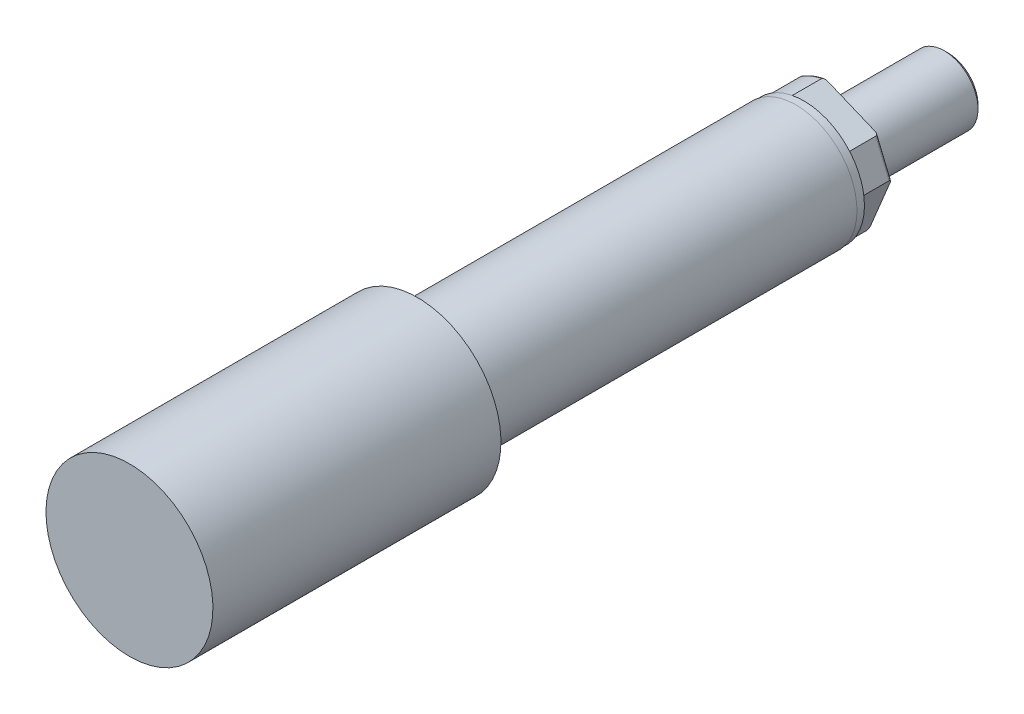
ISO-10303-21;
HEADER;
FILE_DESCRIPTION(('STEP AP214'),'2;1');
FILE_NAME('part.step','',(''),(''),'','','');
FILE_SCHEMA(('AUTOMOTIVE_DESIGN { 1 0 10303 214 1 1 1 1 }'));
ENDSEC;
DATA;
#1=APPLICATION_CONTEXT('core data for automotive mechanical design processes');
#2=APPLICATION_PROTOCOL_DEFINITION('international standard','automotive_design',2000,#1);
#3=PRODUCT_CONTEXT('',#1,'mechanical');
#4=PRODUCT('Part','Part','',(#3));
#5=PRODUCT_RELATED_PRODUCT_CATEGORY('part','',(#4));
#6=PRODUCT_DEFINITION_FORMATION('','',#4);
#7=PRODUCT_DEFINITION_CONTEXT('part definition',#1,'design');
#8=PRODUCT_DEFINITION('design','',#6,#7);
#9=PRODUCT_DEFINITION_SHAPE('','',#8);
#10=(LENGTH_UNIT() NAMED_UNIT(*) SI_UNIT(.MILLI.,.METRE.));
#11=(NAMED_UNIT(*) PLANE_ANGLE_UNIT() SI_UNIT($,.RADIAN.));
#12=(NAMED_UNIT(*) SI_UNIT($,.STERADIAN.) SOLID_ANGLE_UNIT());
#13=UNCERTAINTY_MEASURE_WITH_UNIT(LENGTH_MEASURE(1.E-05),#10,'distance_accuracy_value','');
#14=(GEOMETRIC_REPRESENTATION_CONTEXT(3) GLOBAL_UNCERTAINTY_ASSIGNED_CONTEXT((#13)) GLOBAL_UNIT_ASSIGNED_CONTEXT((#10,
#11,#12)) REPRESENTATION_CONTEXT('',''));
#15=CARTESIAN_POINT('',(0.,0.,0.));
#16=DIRECTION('',(0.,0.,1.));
#17=DIRECTION('',(1.,0.,0.));
#18=AXIS2_PLACEMENT_3D('',#15,#16,#17);
#19=CARTESIAN_POINT('',(0.,0.,-210.0327999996));
#20=DIRECTION('',(0.,0.,1.));
#21=DIRECTION('',(0.923879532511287,-0.382683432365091,0.));
#22=AXIS2_PLACEMENT_3D('',#19,#20,#21);
#23=CYLINDRICAL_SURFACE('',#22,37.719);
#24=CARTESIAN_POINT('',(0.,0.,-270.1799999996));
#25=DIRECTION('',(0.,0.,1.));
#26=DIRECTION('',(0.923879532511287,-0.382683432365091,0.));
#27=AXIS2_PLACEMENT_3D('',#24,#25,#26);
#28=CIRCLE('',#27,37.719);
#29=CARTESIAN_POINT('',(34.8478120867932,-14.4344363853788,-270.1799999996));
#30=VERTEX_POINT('',#29);
#31=EDGE_CURVE('E137',#30,#30,#28,.T.);
#32=ORIENTED_EDGE('',*,*,#31,.F.);
#33=EDGE_LOOP('',(#32));
#34=FACE_BOUND('',#33,.T.);
#35=CARTESIAN_POINT('',(0.,0.,-275.1799999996));
#36=DIRECTION('',(0.,0.,-1.));
#37=DIRECTION('',(-0.923879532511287,0.382683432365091,0.));
#38=AXIS2_PLACEMENT_3D('',#35,#36,#37);
#39=CIRCLE('',#38,37.719);
#40=CARTESIAN_POINT('',(-34.8478120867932,14.4344363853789,-275.1799999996));
#41=VERTEX_POINT('',#40);
#42=EDGE_CURVE('E173',#41,#41,#39,.T.);
#43=ORIENTED_EDGE('',*,*,#42,.F.);
#44=EDGE_LOOP('',(#43));
#45=FACE_BOUND('',#44,.T.);
#46=ADVANCED_FACE('F16',(#34,#45),#23,.T.);
#47=CARTESIAN_POINT('',(14.4344363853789,34.8478120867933,-295.1799999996));
#48=DIRECTION('',(0.,0.,1.));
#49=DIRECTION('',(0.923879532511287,-0.382683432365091,0.));
#50=AXIS2_PLACEMENT_3D('',#47,#48,#49);
#51=PLANE('',#50);
#52=CARTESIAN_POINT('',(0.,0.,-295.1799999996));
#53=DIRECTION('',(0.,0.,1.));
#54=DIRECTION('',(0.923879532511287,-0.382683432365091,0.));
#55=AXIS2_PLACEMENT_3D('',#52,#53,#54);
#56=CIRCLE('',#55,18.495999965);
#57=CARTESIAN_POINT('',(17.088075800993,-7.07811275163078,-295.1799999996));
#58=VERTEX_POINT('',#57);
#59=EDGE_CURVE('E158',#58,#58,#56,.T.);
#60=ORIENTED_EDGE('',*,*,#59,.T.);
#61=EDGE_LOOP('',(#60));
#62=FACE_BOUND('',#61,.T.);
#63=DIRECTION('',(0.923879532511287,-0.382683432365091,0.));
#64=VECTOR('',#63,1.);
#65=CARTESIAN_POINT('',(40.5034519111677,16.7770791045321,-295.1799999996));
#66=LINE('',#65,#64);
#67=CARTESIAN_POINT('',(-4.93911886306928,35.6000082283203,-295.1799999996));
#68=VERTEX_POINT('',#67);
#69=CARTESIAN_POINT('',(24.3744280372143,23.4579395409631,-295.1799999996));
#70=VERTEX_POINT('',#69);
#71=EDGE_CURVE('E153',#68,#70,#66,.T.);
#72=ORIENTED_EDGE('',*,*,#71,.T.);
#73=DIRECTION('',(-0.382683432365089,0.923879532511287,0.));
#74=VECTOR('',#73,1.);
#75=CARTESIAN_POINT('',(18.8918219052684,36.6941216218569,-295.1799999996));
#76=LINE('',#75,#74);
#77=CARTESIAN_POINT('',(33.8225914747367,0.648055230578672,-295.1799999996));
#78=VERTEX_POINT('',#77);
#79=EDGE_CURVE('E269',#70,#78,#76,.F.);
#80=ORIENTED_EDGE('',*,*,#79,.T.);
#81=DIRECTION('',(-0.382683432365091,-0.923879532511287,0.));
#82=VECTOR('',#81,1.);
#83=CARTESIAN_POINT('',(40.5034519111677,16.7770791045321,-295.1799999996));
#84=LINE('',#83,#82);
#85=CARTESIAN_POINT('',(21.6805227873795,-28.6654916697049,-295.1799999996));
#86=VERTEX_POINT('',#85);
#87=EDGE_CURVE('E143',#78,#86,#84,.T.);
#88=ORIENTED_EDGE('',*,*,#87,.T.);
#89=CARTESIAN_POINT('',(0.,0.,-295.1799999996));
#90=DIRECTION('',(0.,0.,1.));
#91=DIRECTION('',(0.923879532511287,-0.382683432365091,0.));
#92=AXIS2_PLACEMENT_3D('',#89,#90,#91);
#93=CIRCLE('',#92,35.941);
#94=CARTESIAN_POINT('',(4.93911886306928,-35.6000082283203,-295.1799999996));
#95=VERTEX_POINT('',#94);
#96=EDGE_CURVE('E284',#86,#95,#93,.F.);
#97=ORIENTED_EDGE('',*,*,#96,.T.);
#98=DIRECTION('',(-0.923879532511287,0.382683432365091,0.));
#99=VECTOR('',#98,1.);
#100=CARTESIAN_POINT('',(16.7770791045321,-40.5034519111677,-295.1799999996));
#101=LINE('',#100,#99);
#102=CARTESIAN_POINT('',(-28.6654916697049,-21.6805227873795,-295.1799999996));
#103=VERTEX_POINT('',#102);
#104=EDGE_CURVE('E146',#95,#103,#101,.T.);
#105=ORIENTED_EDGE('',*,*,#104,.T.);
#106=CARTESIAN_POINT('',(0.,0.,-295.1799999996));
#107=DIRECTION('',(0.,0.,1.));
#108=DIRECTION('',(0.923879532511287,-0.382683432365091,0.));
#109=AXIS2_PLACEMENT_3D('',#106,#107,#108);
#110=CIRCLE('',#109,35.941);
#111=CARTESIAN_POINT('',(-35.6000082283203,-4.93911886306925,-295.1799999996));
#112=VERTEX_POINT('',#111);
#113=EDGE_CURVE('E282',#103,#112,#110,.F.);
#114=ORIENTED_EDGE('',*,*,#113,.T.);
#115=DIRECTION('',(0.382683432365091,0.923879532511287,0.));
#116=VECTOR('',#115,1.);
#117=CARTESIAN_POINT('',(-16.777079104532,40.5034519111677,-295.1799999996));
#118=LINE('',#117,#116);
#119=CARTESIAN_POINT('',(-21.6805227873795,28.6654916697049,-295.1799999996));
#120=VERTEX_POINT('',#119);
#121=EDGE_CURVE('E150',#112,#120,#118,.T.);
#122=ORIENTED_EDGE('',*,*,#121,.T.);
#123=CARTESIAN_POINT('',(0.,0.,-295.1799999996));
#124=DIRECTION('',(0.,0.,1.));
#125=DIRECTION('',(0.923879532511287,-0.382683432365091,0.));
#126=AXIS2_PLACEMENT_3D('',#123,#124,#125);
#127=CIRCLE('',#126,35.941);
#128=EDGE_CURVE('E285',#120,#68,#127,.F.);
#129=ORIENTED_EDGE('',*,*,#128,.T.);
#130=EDGE_LOOP('',(#72,#80,#88,#97,#105,#114,#122,#129));
#131=FACE_BOUND('',#130,.T.);
#132=ADVANCED_FACE('F235',(#62,#131),#51,.F.);
#133=CARTESIAN_POINT('',(16.7770791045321,-40.5034519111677,-275.1799999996));
#134=DIRECTION('',(-0.382683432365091,-0.923879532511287,0.));
#135=DIRECTION('',(0.,0.,-1.));
#136=AXIS2_PLACEMENT_3D('',#133,#134,#135);
#137=PLANE('',#136);
#138=ORIENTED_EDGE('',*,*,#104,.F.);
#139=CARTESIAN_POINT('',(4.93911886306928,-35.6000082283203,-295.1799999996));
#140=CARTESIAN_POINT('',(4.99832987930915,-35.6245342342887,-295.179997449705));
#141=CARTESIAN_POINT('',(5.05753718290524,-35.6490587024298,-295.178965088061));
#142=CARTESIAN_POINT('',(5.17589592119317,-35.698084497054,-295.174771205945));
#143=CARTESIAN_POINT('',(5.23504734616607,-35.7225858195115,-295.171609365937));
#144=CARTESIAN_POINT('',(5.41269190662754,-35.7961686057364,-295.158798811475));
#145=CARTESIAN_POINT('',(5.53100031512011,-35.8451735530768,-295.145824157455));
#146=CARTESIAN_POINT('',(5.7671443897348,-35.9429876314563,-295.110075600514));
#147=CARTESIAN_POINT('',(5.88497196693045,-35.9917934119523,-295.087238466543));
#148=CARTESIAN_POINT('',(6.11821347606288,-36.0884052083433,-295.030530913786));
#149=CARTESIAN_POINT('',(6.23363092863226,-36.1362126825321,-294.996677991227));
#150=CARTESIAN_POINT('',(6.43254813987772,-36.2186068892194,-294.926075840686));
#151=CARTESIAN_POINT('',(6.51688700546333,-36.2535411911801,-294.89210972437));
#152=CARTESIAN_POINT('',(6.68230923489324,-36.322061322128,-294.815821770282));
#153=CARTESIAN_POINT('',(6.76339350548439,-36.355647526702,-294.773502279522));
#154=CARTESIAN_POINT('',(6.92130537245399,-36.4210567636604,-294.678775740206));
#155=CARTESIAN_POINT('',(6.99809311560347,-36.452863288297,-294.626289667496));
#156=CARTESIAN_POINT('',(7.14387346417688,-36.5132474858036,-294.509776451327));
#157=CARTESIAN_POINT('',(7.21288086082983,-36.5418312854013,-294.445771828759));
#158=CARTESIAN_POINT('',(7.31526105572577,-36.5842385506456,-294.330741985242));
#159=CARTESIAN_POINT('',(7.35238511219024,-36.5996158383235,-294.283646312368));
#160=CARTESIAN_POINT('',(7.41994876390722,-36.6276016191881,-294.184077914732));
#161=CARTESIAN_POINT('',(7.45039435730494,-36.6402125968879,-294.131610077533));
#162=CARTESIAN_POINT('',(7.49865078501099,-36.6602010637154,-294.029833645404));
#163=CARTESIAN_POINT('',(7.51766185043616,-36.6680757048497,-293.981197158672));
#164=CARTESIAN_POINT('',(7.54789053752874,-36.6805968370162,-293.88119484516));
#165=CARTESIAN_POINT('',(7.55912658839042,-36.6852509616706,-293.829835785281));
#166=CARTESIAN_POINT('',(7.56865990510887,-36.6891997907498,-293.757679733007));
#167=CARTESIAN_POINT('',(7.57066753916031,-36.6900313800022,-293.737405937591));
#168=CARTESIAN_POINT('',(7.57334922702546,-36.691142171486,-293.696758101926));
#169=CARTESIAN_POINT('',(7.57402345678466,-36.6914214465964,-293.676384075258));
#170=CARTESIAN_POINT('',(7.57402314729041,-36.6914213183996,-293.6559999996));
#171=B_SPLINE_CURVE_WITH_KNOTS('',3,(#139,#140,#141,#142,#143,#144,#145,#146,#147,#148,#149,
#150,#151,#152,#153,#154,#155,#156,#157,#158,#159,#160,#161,#162,#163,#164,#165,#166,#167,#168,
#169,#170),.UNSPECIFIED.,.F.,.F.,(4,2,2,2,2,2,2,2,2,2,2,2,2,2,2,4),(0.,0.192251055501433,
0.38453096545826,0.770306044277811,1.15859203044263,1.54626429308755,1.83813426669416,
2.12992235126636,2.42407675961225,2.71766216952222,2.90288017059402,3.0879311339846,
3.24573831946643,3.40317015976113,3.46429781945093,3.5254174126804),.UNSPECIFIED.);
#172=CARTESIAN_POINT('',(7.5740231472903,-36.6914213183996,-293.6559999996));
#173=VERTEX_POINT('',#172);
#174=EDGE_CURVE('E248',#95,#173,#171,.T.);
#175=ORIENTED_EDGE('',*,*,#174,.T.);
#176=DIRECTION('',(0.,0.,-1.));
#177=VECTOR('',#176,1.);
#178=CARTESIAN_POINT('',(7.57402314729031,-36.6914213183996,-167.427702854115));
#179=LINE('',#178,#177);
#180=CARTESIAN_POINT('',(7.5740231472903,-36.6914213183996,-275.1799999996));
#181=VERTEX_POINT('',#180);
#182=EDGE_CURVE('E316',#173,#181,#179,.F.);
#183=ORIENTED_EDGE('',*,*,#182,.T.);
#184=DIRECTION('',(-0.923879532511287,0.382683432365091,0.));
#185=VECTOR('',#184,1.);
#186=CARTESIAN_POINT('',(16.7770791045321,-40.5034519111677,-275.1799999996));
#187=LINE('',#186,#185);
#188=CARTESIAN_POINT('',(-31.3003959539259,-20.5891096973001,-275.1799999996));
#189=VERTEX_POINT('',#188);
#190=EDGE_CURVE('E134',#181,#189,#187,.T.);
#191=ORIENTED_EDGE('',*,*,#190,.T.);
#192=DIRECTION('',(0.,0.,-1.));
#193=VECTOR('',#192,1.);
#194=CARTESIAN_POINT('',(-31.3003959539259,-20.5891096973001,-167.427702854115));
#195=LINE('',#194,#193);
#196=CARTESIAN_POINT('',(-31.3003959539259,-20.5891096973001,-293.6559999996));
#197=VERTEX_POINT('',#196);
#198=EDGE_CURVE('E121',#189,#197,#195,.T.);
#199=ORIENTED_EDGE('',*,*,#198,.T.);
#200=CARTESIAN_POINT('',(-31.3003959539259,-20.5891096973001,-293.6559999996));
#201=CARTESIAN_POINT('',(-31.3004118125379,-20.589103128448,-293.686203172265));
#202=CARTESIAN_POINT('',(-31.2989193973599,-20.5897213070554,-293.716395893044));
#203=CARTESIAN_POINT('',(-31.2930415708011,-20.5921559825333,-293.776407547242));
#204=CARTESIAN_POINT('',(-31.2886603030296,-20.5939707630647,-293.806226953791));
#205=CARTESIAN_POINT('',(-31.2772021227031,-20.598716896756,-293.864846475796));
#206=CARTESIAN_POINT('',(-31.270160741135,-20.6016335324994,-293.893654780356));
#207=CARTESIAN_POINT('',(-31.2535839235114,-20.60849987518,-293.950415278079));
#208=CARTESIAN_POINT('',(-31.2440477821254,-20.6124498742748,-293.978367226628));
#209=CARTESIAN_POINT('',(-31.2121642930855,-20.6256564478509,-294.060335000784));
#210=CARTESIAN_POINT('',(-31.1864612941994,-20.6363029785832,-294.112849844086));
#211=CARTESIAN_POINT('',(-31.127980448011,-20.6605265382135,-294.213146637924));
#212=CARTESIAN_POINT('',(-31.0951775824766,-20.6741139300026,-294.260910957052));
#213=CARTESIAN_POINT('',(-31.003724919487,-20.711994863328,-294.377743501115));
#214=CARTESIAN_POINT('',(-30.9410998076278,-20.7379350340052,-294.443153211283));
#215=CARTESIAN_POINT('',(-30.8074439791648,-20.7932970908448,-294.562855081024));
#216=CARTESIAN_POINT('',(-30.7363963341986,-20.8227259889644,-294.617124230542));
#217=CARTESIAN_POINT('',(-30.5996359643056,-20.8793739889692,-294.708806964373));
#218=CARTESIAN_POINT('',(-30.5346551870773,-20.9062899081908,-294.747524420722));
#219=CARTESIAN_POINT('',(-30.4018382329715,-20.9613044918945,-294.81879354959));
#220=CARTESIAN_POINT('',(-30.3339999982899,-20.9894040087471,-294.851340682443));
#221=CARTESIAN_POINT('',(-30.1960424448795,-21.0465478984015,-294.911059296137));
#222=CARTESIAN_POINT('',(-30.1259151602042,-21.0755955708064,-294.938208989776));
#223=CARTESIAN_POINT('',(-29.9841814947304,-21.1343035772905,-294.987552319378));
#224=CARTESIAN_POINT('',(-29.9125747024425,-21.1639640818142,-295.009744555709));
#225=CARTESIAN_POINT('',(-29.7438693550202,-21.2338441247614,-295.056387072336));
#226=CARTESIAN_POINT('',(-29.6463506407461,-21.2742376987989,-295.079056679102));
#227=CARTESIAN_POINT('',(-29.4500861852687,-21.3555330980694,-295.117195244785));
#228=CARTESIAN_POINT('',(-29.3513397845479,-21.3964351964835,-295.132660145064));
#229=CARTESIAN_POINT('',(-29.154815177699,-21.4778383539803,-295.156800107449));
#230=CARTESIAN_POINT('',(-29.0570481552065,-21.5183347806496,-295.165583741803));
#231=CARTESIAN_POINT('',(-28.861343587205,-21.5993982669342,-295.177167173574));
#232=CARTESIAN_POINT('',(-28.7634064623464,-21.6399651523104,-295.17997520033));
#233=CARTESIAN_POINT('',(-28.6654916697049,-21.6805227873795,-295.1799999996));
#234=B_SPLINE_CURVE_WITH_KNOTS('',3,(#200,#201,#202,#203,#204,#205,#206,#207,#208,#209,#210,
#211,#212,#213,#214,#215,#216,#217,#218,#219,#220,#221,#222,#223,#224,#225,#226,#227,#228,#229,
#230,#231,#232,#233),.UNSPECIFIED.,.F.,.F.,(4,2,2,2,2,2,2,2,2,2,2,2,2,2,2,2,4),(0.,
0.0905495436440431,0.180969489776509,0.270222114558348,0.359500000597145,0.536883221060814,
0.714901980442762,0.995893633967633,1.27745994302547,1.51798351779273,1.75868337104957,
2.00033593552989,2.24205663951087,2.56564116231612,2.88940775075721,3.20779349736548,
3.5257404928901),.UNSPECIFIED.);
#235=EDGE_CURVE('E242',#197,#103,#234,.T.);
#236=ORIENTED_EDGE('',*,*,#235,.T.);
#237=EDGE_LOOP('',(#138,#175,#183,#191,#199,#236));
#238=FACE_BOUND('',#237,.T.);
#239=ADVANCED_FACE('F230',(#238),#137,.T.);
#240=CARTESIAN_POINT('',(-16.777079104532,40.5034519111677,-275.1799999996));
#241=DIRECTION('',(-0.923879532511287,0.382683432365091,0.));
#242=DIRECTION('',(-0.382683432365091,-0.923879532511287,0.));
#243=AXIS2_PLACEMENT_3D('',#240,#241,#242);
#244=PLANE('',#243);
#245=ORIENTED_EDGE('',*,*,#121,.F.);
#246=CARTESIAN_POINT('',(-35.6000082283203,-4.93911886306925,-295.1799999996));
#247=CARTESIAN_POINT('',(-35.6245342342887,-4.99832987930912,-295.179997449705));
#248=CARTESIAN_POINT('',(-35.6490587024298,-5.05753718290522,-295.178965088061));
#249=CARTESIAN_POINT('',(-35.698084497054,-5.17589592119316,-295.174771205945));
#250=CARTESIAN_POINT('',(-35.7225858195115,-5.23504734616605,-295.171609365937));
#251=CARTESIAN_POINT('',(-35.7961686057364,-5.41269190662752,-295.158798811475));
#252=CARTESIAN_POINT('',(-35.8451735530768,-5.53100031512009,-295.145824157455));
#253=CARTESIAN_POINT('',(-35.9429876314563,-5.76714438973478,-295.110075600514));
#254=CARTESIAN_POINT('',(-35.9917934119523,-5.88497196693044,-295.087238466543));
#255=CARTESIAN_POINT('',(-36.0884052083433,-6.11821347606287,-295.030530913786));
#256=CARTESIAN_POINT('',(-36.1362126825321,-6.23363092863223,-294.996677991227));
#257=CARTESIAN_POINT('',(-36.2186068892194,-6.43254813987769,-294.926075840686));
#258=CARTESIAN_POINT('',(-36.2535411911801,-6.51688700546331,-294.89210972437));
#259=CARTESIAN_POINT('',(-36.322061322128,-6.68230923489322,-294.815821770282));
#260=CARTESIAN_POINT('',(-36.355647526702,-6.76339350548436,-294.773502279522));
#261=CARTESIAN_POINT('',(-36.4210567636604,-6.92130537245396,-294.678775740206));
#262=CARTESIAN_POINT('',(-36.452863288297,-6.99809311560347,-294.626289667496));
#263=CARTESIAN_POINT('',(-36.5132474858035,-7.14387346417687,-294.509776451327));
#264=CARTESIAN_POINT('',(-36.5418312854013,-7.21288086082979,-294.445771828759));
#265=CARTESIAN_POINT('',(-36.5842385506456,-7.31526105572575,-294.330741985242));
#266=CARTESIAN_POINT('',(-36.5996158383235,-7.35238511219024,-294.283646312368));
#267=CARTESIAN_POINT('',(-36.6276016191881,-7.41994876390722,-294.184077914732));
#268=CARTESIAN_POINT('',(-36.6402125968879,-7.4503943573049,-294.131610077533));
#269=CARTESIAN_POINT('',(-36.6602010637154,-7.49865078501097,-294.029833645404));
#270=CARTESIAN_POINT('',(-36.6680757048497,-7.51766185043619,-293.981197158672));
#271=CARTESIAN_POINT('',(-36.6805968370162,-7.54789053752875,-293.88119484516));
#272=CARTESIAN_POINT('',(-36.6852509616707,-7.55912658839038,-293.829835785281));
#273=CARTESIAN_POINT('',(-36.6891997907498,-7.56865990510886,-293.757679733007));
#274=CARTESIAN_POINT('',(-36.6900313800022,-7.57066753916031,-293.737405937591));
#275=CARTESIAN_POINT('',(-36.691142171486,-7.57334922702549,-293.696758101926));
#276=CARTESIAN_POINT('',(-36.6914214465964,-7.57402345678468,-293.676384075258));
#277=CARTESIAN_POINT('',(-36.6914213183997,-7.57402314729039,-293.6559999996));
#278=B_SPLINE_CURVE_WITH_KNOTS('',3,(#246,#247,#248,#249,#250,#251,#252,#253,#254,#255,#256,
#257,#258,#259,#260,#261,#262,#263,#264,#265,#266,#267,#268,#269,#270,#271,#272,#273,#274,#275,
#276,#277),.UNSPECIFIED.,.F.,.F.,(4,2,2,2,2,2,2,2,2,2,2,2,2,2,2,4),(0.,0.192251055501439,
0.384530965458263,0.770306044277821,1.15859203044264,1.54626429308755,1.83813426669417,
2.12992235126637,2.42407675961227,2.71766216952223,2.90288017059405,3.08793113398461,
3.24573831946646,3.40317015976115,3.46429781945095,3.52541741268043),.UNSPECIFIED.);
#279=CARTESIAN_POINT('',(-36.6914213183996,-7.57402314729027,-293.6559999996));
#280=VERTEX_POINT('',#279);
#281=EDGE_CURVE('E33',#112,#280,#278,.T.);
#282=ORIENTED_EDGE('',*,*,#281,.T.);
#283=DIRECTION('',(0.,0.,-1.));
#284=VECTOR('',#283,1.);
#285=CARTESIAN_POINT('',(-36.6914213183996,-7.57402314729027,-167.427702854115));
#286=LINE('',#285,#284);
#287=CARTESIAN_POINT('',(-36.6914213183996,-7.57402314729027,-275.1799999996));
#288=VERTEX_POINT('',#287);
#289=EDGE_CURVE('E107',#280,#288,#286,.F.);
#290=ORIENTED_EDGE('',*,*,#289,.T.);
#291=DIRECTION('',(0.382683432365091,0.923879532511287,0.));
#292=VECTOR('',#291,1.);
#293=CARTESIAN_POINT('',(-16.777079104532,40.5034519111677,-275.1799999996));
#294=LINE('',#293,#292);
#295=CARTESIAN_POINT('',(-20.5891096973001,31.3003959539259,-275.1799999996));
#296=VERTEX_POINT('',#295);
#297=EDGE_CURVE('E111',#288,#296,#294,.T.);
#298=ORIENTED_EDGE('',*,*,#297,.T.);
#299=DIRECTION('',(0.,0.,-1.));
#300=VECTOR('',#299,1.);
#301=CARTESIAN_POINT('',(-20.5891096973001,31.3003959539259,-167.427702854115));
#302=LINE('',#301,#300);
#303=CARTESIAN_POINT('',(-20.5891096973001,31.3003959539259,-293.6559999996));
#304=VERTEX_POINT('',#303);
#305=EDGE_CURVE('E114',#296,#304,#302,.T.);
#306=ORIENTED_EDGE('',*,*,#305,.T.);
#307=CARTESIAN_POINT('',(-20.5891096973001,31.3003959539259,-293.6559999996));
#308=CARTESIAN_POINT('',(-20.5891031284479,31.300411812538,-293.686203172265));
#309=CARTESIAN_POINT('',(-20.5897213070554,31.2989193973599,-293.716395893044));
#310=CARTESIAN_POINT('',(-20.5921559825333,31.2930415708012,-293.776407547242));
#311=CARTESIAN_POINT('',(-20.5939707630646,31.2886603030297,-293.806226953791));
#312=CARTESIAN_POINT('',(-20.598716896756,31.2772021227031,-293.864846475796));
#313=CARTESIAN_POINT('',(-20.6016335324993,31.270160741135,-293.893654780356));
#314=CARTESIAN_POINT('',(-20.60849987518,31.2535839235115,-293.950415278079));
#315=CARTESIAN_POINT('',(-20.6124498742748,31.2440477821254,-293.978367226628));
#316=CARTESIAN_POINT('',(-20.6256564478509,31.2121642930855,-294.060335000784));
#317=CARTESIAN_POINT('',(-20.6363029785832,31.1864612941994,-294.112849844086));
#318=CARTESIAN_POINT('',(-20.6605265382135,31.1279804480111,-294.213146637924));
#319=CARTESIAN_POINT('',(-20.6741139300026,31.0951775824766,-294.260910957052));
#320=CARTESIAN_POINT('',(-20.711994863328,31.003724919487,-294.377743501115));
#321=CARTESIAN_POINT('',(-20.7379350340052,30.9410998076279,-294.443153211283));
#322=CARTESIAN_POINT('',(-20.7932970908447,30.8074439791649,-294.562855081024));
#323=CARTESIAN_POINT('',(-20.8227259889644,30.7363963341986,-294.617124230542));
#324=CARTESIAN_POINT('',(-20.8793739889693,30.5996359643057,-294.708806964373));
#325=CARTESIAN_POINT('',(-20.9062899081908,30.5346551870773,-294.747524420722));
#326=CARTESIAN_POINT('',(-20.9613044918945,30.4018382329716,-294.81879354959));
#327=CARTESIAN_POINT('',(-20.989404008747,30.33399999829,-294.851340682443));
#328=CARTESIAN_POINT('',(-21.0465478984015,30.1960424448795,-294.911059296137));
#329=CARTESIAN_POINT('',(-21.0755955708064,30.1259151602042,-294.938208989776));
#330=CARTESIAN_POINT('',(-21.1343035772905,29.9841814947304,-294.987552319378));
#331=CARTESIAN_POINT('',(-21.1639640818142,29.9125747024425,-295.009744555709));
#332=CARTESIAN_POINT('',(-21.2338441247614,29.7438693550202,-295.056387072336));
#333=CARTESIAN_POINT('',(-21.2742376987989,29.6463506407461,-295.079056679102));
#334=CARTESIAN_POINT('',(-21.3555330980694,29.4500861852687,-295.117195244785));
#335=CARTESIAN_POINT('',(-21.3964351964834,29.3513397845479,-295.132660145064));
#336=CARTESIAN_POINT('',(-21.4778383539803,29.154815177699,-295.156800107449));
#337=CARTESIAN_POINT('',(-21.5183347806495,29.0570481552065,-295.165583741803));
#338=CARTESIAN_POINT('',(-21.5993982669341,28.861343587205,-295.177167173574));
#339=CARTESIAN_POINT('',(-21.6399651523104,28.7634064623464,-295.17997520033));
#340=CARTESIAN_POINT('',(-21.6805227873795,28.6654916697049,-295.1799999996));
#341=B_SPLINE_CURVE_WITH_KNOTS('',3,(#307,#308,#309,#310,#311,#312,#313,#314,#315,#316,#317,
#318,#319,#320,#321,#322,#323,#324,#325,#326,#327,#328,#329,#330,#331,#332,#333,#334,#335,#336,
#337,#338,#339,#340),.UNSPECIFIED.,.F.,.F.,(4,2,2,2,2,2,2,2,2,2,2,2,2,2,2,2,4),(0.,
0.0905495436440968,0.180969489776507,0.270222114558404,0.359500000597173,0.536883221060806,
0.714901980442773,0.995893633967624,1.27745994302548,1.51798351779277,1.75868337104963,
2.00033593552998,2.24205663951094,2.56564116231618,2.88940775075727,3.20779349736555,
3.52574049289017),.UNSPECIFIED.);
#342=EDGE_CURVE('E213',#304,#120,#341,.T.);
#343=ORIENTED_EDGE('',*,*,#342,.T.);
#344=EDGE_LOOP('',(#245,#282,#290,#298,#306,#343));
#345=FACE_BOUND('',#344,.T.);
#346=ADVANCED_FACE('F109',(#345),#244,.T.);
#347=CARTESIAN_POINT('',(40.5034519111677,16.7770791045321,-275.1799999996));
#348=DIRECTION('',(0.382683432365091,0.923879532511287,0.));
#349=DIRECTION('',(0.,0.,1.));
#350=AXIS2_PLACEMENT_3D('',#347,#348,#349);
#351=PLANE('',#350);
#352=DIRECTION('',(0.,0.,1.));
#353=VECTOR('',#352,1.);
#354=CARTESIAN_POINT('',(26.3656299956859,22.6331566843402,-275.1799999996));
#355=LINE('',#354,#353);
#356=CARTESIAN_POINT('',(26.3656299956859,22.6331566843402,-293.6559999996));
#357=VERTEX_POINT('',#356);
#358=CARTESIAN_POINT('',(26.3656299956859,22.6331566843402,-275.1799999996));
#359=VERTEX_POINT('',#358);
#360=EDGE_CURVE('E292',#357,#359,#355,.T.);
#361=ORIENTED_EDGE('',*,*,#360,.F.);
#362=CARTESIAN_POINT('',(24.3744280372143,23.4579395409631,-293.6559999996));
#363=DIRECTION('',(0.382683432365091,0.923879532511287,0.));
#364=DIRECTION('',(-0.923879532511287,0.382683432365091,0.));
#365=AXIS2_PLACEMENT_3D('',#362,#363,#364);
#366=ELLIPSE('',#365,2.15526146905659,1.524);
#367=EDGE_CURVE('E193',#357,#70,#366,.T.);
#368=ORIENTED_EDGE('',*,*,#367,.T.);
#369=ORIENTED_EDGE('',*,*,#71,.F.);
#370=CARTESIAN_POINT('',(-4.93911886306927,35.6000082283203,-295.1799999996));
#371=CARTESIAN_POINT('',(-4.99832987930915,35.6245342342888,-295.179997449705));
#372=CARTESIAN_POINT('',(-5.05753718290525,35.6490587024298,-295.178965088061));
#373=CARTESIAN_POINT('',(-5.17589592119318,35.698084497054,-295.174771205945));
#374=CARTESIAN_POINT('',(-5.23504734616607,35.7225858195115,-295.171609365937));
#375=CARTESIAN_POINT('',(-5.41269190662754,35.7961686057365,-295.158798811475));
#376=CARTESIAN_POINT('',(-5.53100031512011,35.8451735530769,-295.145824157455));
#377=CARTESIAN_POINT('',(-5.76714438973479,35.9429876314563,-295.110075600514));
#378=CARTESIAN_POINT('',(-5.88497196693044,35.9917934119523,-295.087238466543));
#379=CARTESIAN_POINT('',(-6.11821347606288,36.0884052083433,-295.030530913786));
#380=CARTESIAN_POINT('',(-6.23363092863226,36.1362126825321,-294.996677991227));
#381=CARTESIAN_POINT('',(-6.43254813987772,36.2186068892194,-294.926075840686));
#382=CARTESIAN_POINT('',(-6.51688700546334,36.2535411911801,-294.89210972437));
#383=CARTESIAN_POINT('',(-6.68230923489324,36.322061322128,-294.815821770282));
#384=CARTESIAN_POINT('',(-6.76339350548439,36.355647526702,-294.773502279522));
#385=CARTESIAN_POINT('',(-6.92130537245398,36.4210567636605,-294.678775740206));
#386=CARTESIAN_POINT('',(-6.99809311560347,36.452863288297,-294.626289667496));
#387=CARTESIAN_POINT('',(-7.14387346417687,36.5132474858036,-294.509776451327));
#388=CARTESIAN_POINT('',(-7.21288086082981,36.5418312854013,-294.445771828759));
#389=CARTESIAN_POINT('',(-7.31526105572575,36.5842385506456,-294.330741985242));
#390=CARTESIAN_POINT('',(-7.35238511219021,36.5996158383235,-294.283646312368));
#391=CARTESIAN_POINT('',(-7.4199487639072,36.6276016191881,-294.184077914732));
#392=CARTESIAN_POINT('',(-7.45039435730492,36.640212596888,-294.131610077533));
#393=CARTESIAN_POINT('',(-7.49865078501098,36.6602010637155,-294.029833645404));
#394=CARTESIAN_POINT('',(-7.51766185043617,36.6680757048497,-293.981197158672));
#395=CARTESIAN_POINT('',(-7.54789053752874,36.6805968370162,-293.88119484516));
#396=CARTESIAN_POINT('',(-7.5591265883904,36.6852509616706,-293.829835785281));
#397=CARTESIAN_POINT('',(-7.56865990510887,36.6891997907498,-293.757679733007));
#398=CARTESIAN_POINT('',(-7.57066753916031,36.6900313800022,-293.737405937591));
#399=CARTESIAN_POINT('',(-7.57334922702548,36.691142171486,-293.696758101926));
#400=CARTESIAN_POINT('',(-7.57402345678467,36.6914214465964,-293.676384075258));
#401=CARTESIAN_POINT('',(-7.5740231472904,36.6914213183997,-293.6559999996));
#402=B_SPLINE_CURVE_WITH_KNOTS('',3,(#370,#371,#372,#373,#374,#375,#376,#377,#378,#379,#380,
#381,#382,#383,#384,#385,#386,#387,#388,#389,#390,#391,#392,#393,#394,#395,#396,#397,#398,#399,
#400,#401),.UNSPECIFIED.,.F.,.F.,(4,2,2,2,2,2,2,2,2,2,2,2,2,2,2,4),(0.,0.192251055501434,
0.384530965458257,0.770306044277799,1.15859203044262,1.54626429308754,1.83813426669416,
2.12992235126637,2.42407675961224,2.71766216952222,2.90288017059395,3.0879311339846,
3.24573831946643,3.40317015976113,3.46429781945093,3.5254174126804),.UNSPECIFIED.);
#403=CARTESIAN_POINT('',(-7.57402314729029,36.6914213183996,-293.6559999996));
#404=VERTEX_POINT('',#403);
#405=EDGE_CURVE('E185',#68,#404,#402,.T.);
#406=ORIENTED_EDGE('',*,*,#405,.T.);
#407=DIRECTION('',(0.,0.,-1.));
#408=VECTOR('',#407,1.);
#409=CARTESIAN_POINT('',(-7.57402314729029,36.6914213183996,-167.427702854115));
#410=LINE('',#409,#408);
#411=CARTESIAN_POINT('',(-7.57402314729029,36.6914213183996,-275.1799999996));
#412=VERTEX_POINT('',#411);
#413=EDGE_CURVE('E115',#404,#412,#410,.F.);
#414=ORIENTED_EDGE('',*,*,#413,.T.);
#415=DIRECTION('',(0.923879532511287,-0.382683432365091,0.));
#416=VECTOR('',#415,1.);
#417=CARTESIAN_POINT('',(40.5034519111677,16.7770791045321,-275.1799999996));
#418=LINE('',#417,#416);
#419=EDGE_CURVE('E133',#412,#359,#418,.T.);
#420=ORIENTED_EDGE('',*,*,#419,.T.);
#421=EDGE_LOOP('',(#361,#368,#369,#406,#414,#420));
#422=FACE_BOUND('',#421,.T.);
#423=ADVANCED_FACE('F195',(#422),#351,.T.);
#424=CARTESIAN_POINT('',(40.5034519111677,16.7770791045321,-275.1799999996));
#425=DIRECTION('',(0.923879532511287,-0.382683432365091,0.));
#426=DIRECTION('',(0.382683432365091,0.923879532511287,0.));
#427=AXIS2_PLACEMENT_3D('',#424,#425,#426);
#428=PLANE('',#427);
#429=ORIENTED_EDGE('',*,*,#87,.F.);
#430=CARTESIAN_POINT('',(33.8225914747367,0.648055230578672,-293.6559999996));
#431=DIRECTION('',(0.923879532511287,-0.382683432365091,0.));
#432=DIRECTION('',(0.382683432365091,0.923879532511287,0.));
#433=AXIS2_PLACEMENT_3D('',#430,#431,#432);
#434=ELLIPSE('',#433,2.15526146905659,1.524);
#435=CARTESIAN_POINT('',(34.6473743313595,2.63925718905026,-293.6559999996));
#436=VERTEX_POINT('',#435);
#437=EDGE_CURVE('E268',#78,#436,#434,.T.);
#438=ORIENTED_EDGE('',*,*,#437,.T.);
#439=DIRECTION('',(0.,0.,-1.));
#440=VECTOR('',#439,1.);
#441=CARTESIAN_POINT('',(34.6473743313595,2.63925718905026,-275.1799999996));
#442=LINE('',#441,#440);
#443=CARTESIAN_POINT('',(34.6473743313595,2.63925718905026,-275.1799999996));
#444=VERTEX_POINT('',#443);
#445=EDGE_CURVE('E176',#444,#436,#442,.T.);
#446=ORIENTED_EDGE('',*,*,#445,.F.);
#447=DIRECTION('',(-0.382683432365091,-0.923879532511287,0.));
#448=VECTOR('',#447,1.);
#449=CARTESIAN_POINT('',(40.5034519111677,16.7770791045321,-275.1799999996));
#450=LINE('',#449,#448);
#451=CARTESIAN_POINT('',(20.5891096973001,-31.3003959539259,-275.1799999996));
#452=VERTEX_POINT('',#451);
#453=EDGE_CURVE('E139',#444,#452,#450,.T.);
#454=ORIENTED_EDGE('',*,*,#453,.T.);
#455=DIRECTION('',(0.,0.,-1.));
#456=VECTOR('',#455,1.);
#457=CARTESIAN_POINT('',(20.5891096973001,-31.3003959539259,-167.427702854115));
#458=LINE('',#457,#456);
#459=CARTESIAN_POINT('',(20.5891096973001,-31.3003959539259,-293.6559999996));
#460=VERTEX_POINT('',#459);
#461=EDGE_CURVE('E179',#452,#460,#458,.T.);
#462=ORIENTED_EDGE('',*,*,#461,.T.);
#463=CARTESIAN_POINT('',(20.5891096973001,-31.3003959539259,-293.6559999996));
#464=CARTESIAN_POINT('',(20.589103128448,-31.3004118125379,-293.686203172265));
#465=CARTESIAN_POINT('',(20.5897213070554,-31.2989193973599,-293.716395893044));
#466=CARTESIAN_POINT('',(20.5921559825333,-31.2930415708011,-293.776407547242));
#467=CARTESIAN_POINT('',(20.5939707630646,-31.2886603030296,-293.806226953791));
#468=CARTESIAN_POINT('',(20.598716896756,-31.2772021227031,-293.864846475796));
#469=CARTESIAN_POINT('',(20.6016335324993,-31.270160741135,-293.893654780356));
#470=CARTESIAN_POINT('',(20.60849987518,-31.2535839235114,-293.950415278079));
#471=CARTESIAN_POINT('',(20.6124498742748,-31.2440477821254,-293.978367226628));
#472=CARTESIAN_POINT('',(20.625656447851,-31.2121642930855,-294.060335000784));
#473=CARTESIAN_POINT('',(20.6363029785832,-31.1864612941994,-294.112849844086));
#474=CARTESIAN_POINT('',(20.6605265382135,-31.127980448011,-294.213146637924));
#475=CARTESIAN_POINT('',(20.6741139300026,-31.0951775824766,-294.260910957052));
#476=CARTESIAN_POINT('',(20.711994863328,-31.003724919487,-294.377743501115));
#477=CARTESIAN_POINT('',(20.7379350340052,-30.9410998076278,-294.443153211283));
#478=CARTESIAN_POINT('',(20.7932970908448,-30.8074439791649,-294.562855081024));
#479=CARTESIAN_POINT('',(20.8227259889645,-30.7363963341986,-294.617124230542));
#480=CARTESIAN_POINT('',(20.8793739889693,-30.5996359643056,-294.708806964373));
#481=CARTESIAN_POINT('',(20.9062899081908,-30.5346551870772,-294.747524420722));
#482=CARTESIAN_POINT('',(20.9613044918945,-30.4018382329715,-294.81879354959));
#483=CARTESIAN_POINT('',(20.9894040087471,-30.3339999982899,-294.851340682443));
#484=CARTESIAN_POINT('',(21.0465478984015,-30.1960424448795,-294.911059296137));
#485=CARTESIAN_POINT('',(21.0755955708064,-30.1259151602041,-294.938208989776));
#486=CARTESIAN_POINT('',(21.1343035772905,-29.9841814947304,-294.987552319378));
#487=CARTESIAN_POINT('',(21.1639640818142,-29.9125747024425,-295.009744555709));
#488=CARTESIAN_POINT('',(21.2338441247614,-29.7438693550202,-295.056387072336));
#489=CARTESIAN_POINT('',(21.2742376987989,-29.6463506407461,-295.079056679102));
#490=CARTESIAN_POINT('',(21.3555330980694,-29.4500861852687,-295.117195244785));
#491=CARTESIAN_POINT('',(21.3964351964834,-29.3513397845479,-295.132660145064));
#492=CARTESIAN_POINT('',(21.4778383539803,-29.154815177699,-295.156800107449));
#493=CARTESIAN_POINT('',(21.5183347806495,-29.0570481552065,-295.165583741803));
#494=CARTESIAN_POINT('',(21.5993982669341,-28.861343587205,-295.177167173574));
#495=CARTESIAN_POINT('',(21.6399651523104,-28.7634064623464,-295.17997520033));
#496=CARTESIAN_POINT('',(21.6805227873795,-28.6654916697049,-295.1799999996));
#497=B_SPLINE_CURVE_WITH_KNOTS('',3,(#463,#464,#465,#466,#467,#468,#469,#470,#471,#472,#473,
#474,#475,#476,#477,#478,#479,#480,#481,#482,#483,#484,#485,#486,#487,#488,#489,#490,#491,#492,
#493,#494,#495,#496),.UNSPECIFIED.,.F.,.F.,(4,2,2,2,2,2,2,2,2,2,2,2,2,2,2,2,4),(0.,
0.0905495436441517,0.180969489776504,0.270222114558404,0.359500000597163,0.536883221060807,
0.714901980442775,0.995893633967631,1.2774599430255,1.51798351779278,1.75868337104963,
2.00033593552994,2.24205663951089,2.56564116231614,2.88940775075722,3.2077934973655,
3.52574049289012),.UNSPECIFIED.);
#498=EDGE_CURVE('E262',#460,#86,#497,.T.);
#499=ORIENTED_EDGE('',*,*,#498,.T.);
#500=EDGE_LOOP('',(#429,#438,#446,#454,#462,#499));
#501=FACE_BOUND('',#500,.T.);
#502=ADVANCED_FACE('F237',(#501),#428,.T.);
#503=CARTESIAN_POINT('',(0.,0.,-365.0299999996));
#504=DIRECTION('',(0.,0.,1.));
#505=DIRECTION('',(0.923879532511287,-0.382683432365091,0.));
#506=AXIS2_PLACEMENT_3D('',#503,#504,#505);
#507=PLANE('',#506);
#508=CARTESIAN_POINT('',(0.,0.,-365.0299999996));
#509=DIRECTION('',(0.,0.,1.));
#510=DIRECTION('',(0.923879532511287,-0.382683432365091,0.));
#511=AXIS2_PLACEMENT_3D('',#508,#509,#510);
#512=CIRCLE('',#511,2.9845);
#513=CARTESIAN_POINT('',(2.75731846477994,-1.1421187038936,-365.0299999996));
#514=VERTEX_POINT('',#513);
#515=EDGE_CURVE('E147',#514,#514,#512,.T.);
#516=ORIENTED_EDGE('',*,*,#515,.T.);
#517=EDGE_LOOP('',(#516));
#518=FACE_BOUND('',#517,.T.);
#519=CARTESIAN_POINT('',(0.,0.,-365.0299999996));
#520=DIRECTION('',(0.,0.,1.));
#521=DIRECTION('',(0.923879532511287,-0.382683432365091,0.));
#522=AXIS2_PLACEMENT_3D('',#519,#520,#521);
#523=CIRCLE('',#522,18.714);
#524=CARTESIAN_POINT('',(17.2894815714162,-7.16153775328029,-365.0299999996));
#525=VERTEX_POINT('',#524);
#526=EDGE_CURVE('E170',#525,#525,#523,.F.);
#527=ORIENTED_EDGE('',*,*,#526,.T.);
#528=EDGE_LOOP('',(#527));
#529=FACE_BOUND('',#528,.T.);
#530=ADVANCED_FACE('F581',(#518,#529),#507,.F.);
#531=CARTESIAN_POINT('',(0.,0.,-210.0327999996));
#532=DIRECTION('',(0.,0.,1.));
#533=DIRECTION('',(0.923879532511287,-0.382683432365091,0.));
#534=AXIS2_PLACEMENT_3D('',#531,#532,#533);
#535=CYLINDRICAL_SURFACE('',#534,21.);
#536=CARTESIAN_POINT('',(0.,0.,-362.7439999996));
#537=DIRECTION('',(0.,0.,1.));
#538=DIRECTION('',(0.923879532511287,-0.382683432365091,0.));
#539=AXIS2_PLACEMENT_3D('',#536,#537,#538);
#540=CIRCLE('',#539,21.);
#541=CARTESIAN_POINT('',(19.401470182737,-8.03635207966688,-362.7439999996));
#542=VERTEX_POINT('',#541);
#543=EDGE_CURVE('E167',#542,#542,#540,.T.);
#544=ORIENTED_EDGE('',*,*,#543,.T.);
#545=EDGE_LOOP('',(#544));
#546=FACE_BOUND('',#545,.T.);
#547=CARTESIAN_POINT('',(0.,0.,-301.7839999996));
#548=DIRECTION('',(0.,0.,1.));
#549=DIRECTION('',(0.923879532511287,-0.382683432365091,0.));
#550=AXIS2_PLACEMENT_3D('',#547,#548,#549);
#551=CIRCLE('',#550,21.);
#552=CARTESIAN_POINT('',(19.401470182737,-8.03635207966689,-301.7839999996));
#553=VERTEX_POINT('',#552);
#554=EDGE_CURVE('E164',#553,#553,#551,.T.);
#555=ORIENTED_EDGE('',*,*,#554,.F.);
#556=EDGE_LOOP('',(#555));
#557=FACE_BOUND('',#556,.T.);
#558=ADVANCED_FACE('F570',(#546,#557),#535,.T.);
#559=CARTESIAN_POINT('',(8.03635207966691,19.4014701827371,-301.7839999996));
#560=DIRECTION('',(0.,0.,-1.));
#561=DIRECTION('',(-0.923879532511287,0.382683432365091,0.));
#562=AXIS2_PLACEMENT_3D('',#559,#560,#561);
#563=PLANE('',#562);
#564=CARTESIAN_POINT('',(0.,0.,-301.7839999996));
#565=DIRECTION('',(0.,0.,1.));
#566=DIRECTION('',(0.923879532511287,-0.382683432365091,0.));
#567=AXIS2_PLACEMENT_3D('',#564,#565,#566);
#568=CIRCLE('',#567,18.495999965);
#569=CARTESIAN_POINT('',(17.088075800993,-7.07811275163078,-301.7839999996));
#570=VERTEX_POINT('',#569);
#571=EDGE_CURVE('E161',#570,#570,#568,.T.);
#572=ORIENTED_EDGE('',*,*,#571,.F.);
#573=EDGE_LOOP('',(#572));
#574=FACE_BOUND('',#573,.T.);
#575=ORIENTED_EDGE('',*,*,#554,.T.);
#576=EDGE_LOOP('',(#575));
#577=FACE_BOUND('',#576,.T.);
#578=ADVANCED_FACE('F559',(#574,#577),#563,.F.);
#579=CARTESIAN_POINT('',(0.,0.,-210.0327999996));
#580=DIRECTION('',(0.,0.,1.));
#581=DIRECTION('',(0.923879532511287,-0.382683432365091,0.));
#582=AXIS2_PLACEMENT_3D('',#579,#580,#581);
#583=CYLINDRICAL_SURFACE('',#582,18.495999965);
#584=ORIENTED_EDGE('',*,*,#59,.F.);
#585=EDGE_LOOP('',(#584));
#586=FACE_BOUND('',#585,.T.);
#587=ORIENTED_EDGE('',*,*,#571,.T.);
#588=EDGE_LOOP('',(#587));
#589=FACE_BOUND('',#588,.T.);
#590=ADVANCED_FACE('F549',(#586,#589),#583,.T.);
#591=CARTESIAN_POINT('',(0.,0.,-362.7439999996));
#592=DIRECTION('',(0.,0.,1.));
#593=DIRECTION('',(0.923879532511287,-0.382683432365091,0.));
#594=AXIS2_PLACEMENT_3D('',#591,#592,#593);
#595=CONICAL_SURFACE('',#594,21.,0.785398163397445);
#596=ORIENTED_EDGE('',*,*,#526,.F.);
#597=EDGE_LOOP('',(#596));
#598=FACE_BOUND('',#597,.T.);
#599=ORIENTED_EDGE('',*,*,#543,.F.);
#600=EDGE_LOOP('',(#599));
#601=FACE_BOUND('',#600,.T.);
#602=ADVANCED_FACE('F540',(#598,#601),#595,.T.);
#603=CARTESIAN_POINT('',(0.,0.,-275.1799999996));
#604=DIRECTION('',(0.,0.,-1.));
#605=DIRECTION('',(-0.923879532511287,0.382683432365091,0.));
#606=AXIS2_PLACEMENT_3D('',#603,#604,#605);
#607=PLANE('',#606);
#608=CARTESIAN_POINT('',(0.,0.,-275.1799999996));
#609=DIRECTION('',(0.,0.,-1.));
#610=DIRECTION('',(-0.923879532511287,0.382683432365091,0.));
#611=AXIS2_PLACEMENT_3D('',#608,#609,#610);
#612=CIRCLE('',#611,37.465);
#613=EDGE_CURVE('E118',#288,#189,#612,.F.);
#614=ORIENTED_EDGE('',*,*,#613,.T.);
#615=ORIENTED_EDGE('',*,*,#190,.F.);
#616=EDGE_CURVE('E125',#181,#452,#612,.F.);
#617=ORIENTED_EDGE('',*,*,#616,.T.);
#618=ORIENTED_EDGE('',*,*,#453,.F.);
#619=DIRECTION('',(0.382683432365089,-0.923879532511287,0.));
#620=VECTOR('',#619,1.);
#621=CARTESIAN_POINT('',(23.5294520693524,29.4802958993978,-275.1799999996));
#622=LINE('',#621,#620);
#623=EDGE_CURVE('E299',#359,#444,#622,.T.);
#624=ORIENTED_EDGE('',*,*,#623,.F.);
#625=ORIENTED_EDGE('',*,*,#419,.F.);
#626=EDGE_CURVE('E127',#412,#296,#612,.F.);
#627=ORIENTED_EDGE('',*,*,#626,.T.);
#628=ORIENTED_EDGE('',*,*,#297,.F.);
#629=EDGE_LOOP('',(#614,#615,#617,#618,#624,#625,#627,#628));
#630=FACE_BOUND('',#629,.T.);
#631=ORIENTED_EDGE('',*,*,#42,.T.);
#632=EDGE_LOOP('',(#631));
#633=FACE_BOUND('',#632,.T.);
#634=ADVANCED_FACE('F129',(#630,#633),#607,.T.);
#635=CARTESIAN_POINT('',(0.,0.,-365.0299999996));
#636=DIRECTION('',(0.,0.,-1.));
#637=DIRECTION('',(-0.923879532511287,0.382683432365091,0.));
#638=AXIS2_PLACEMENT_3D('',#635,#636,#637);
#639=CONICAL_SURFACE('',#638,2.9845,0.523598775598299);
#640=CARTESIAN_POINT('',(0.,0.,-362.610325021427));
#641=DIRECTION('',(0.,0.,1.));
#642=DIRECTION('',(0.923879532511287,-0.382683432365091,0.));
#643=AXIS2_PLACEMENT_3D('',#640,#641,#642);
#644=CIRCLE('',#643,1.5875);
#645=CARTESIAN_POINT('',(1.46665875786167,-0.607509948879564,-362.610325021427));
#646=VERTEX_POINT('',#645);
#647=EDGE_CURVE('E307',#646,#646,#644,.T.);
#648=ORIENTED_EDGE('',*,*,#647,.T.);
#649=EDGE_LOOP('',(#648));
#650=FACE_BOUND('',#649,.T.);
#651=ORIENTED_EDGE('',*,*,#515,.F.);
#652=EDGE_LOOP('',(#651));
#653=FACE_BOUND('',#652,.T.);
#654=ADVANCED_FACE('F520',(#650,#653),#639,.F.);
#655=CARTESIAN_POINT('',(0.,0.,-365.0299999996));
#656=DIRECTION('',(0.,0.,1.));
#657=DIRECTION('',(0.923879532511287,-0.382683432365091,0.));
#658=AXIS2_PLACEMENT_3D('',#655,#656,#657);
#659=CYLINDRICAL_SURFACE('',#658,1.5875);
#660=CARTESIAN_POINT('',(0.,0.,-359.310468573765));
#661=DIRECTION('',(0.,0.,1.));
#662=DIRECTION('',(0.923879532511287,-0.382683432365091,0.));
#663=AXIS2_PLACEMENT_3D('',#660,#661,#662);
#664=CIRCLE('',#663,1.5875);
#665=CARTESIAN_POINT('',(1.46665875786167,-0.607509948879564,-359.310468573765));
#666=VERTEX_POINT('',#665);
#667=EDGE_CURVE('E310',#666,#666,#664,.T.);
#668=ORIENTED_EDGE('',*,*,#667,.T.);
#669=EDGE_LOOP('',(#668));
#670=FACE_BOUND('',#669,.T.);
#671=ORIENTED_EDGE('',*,*,#647,.F.);
#672=EDGE_LOOP('',(#671));
#673=FACE_BOUND('',#672,.T.);
#674=ADVANCED_FACE('F509',(#670,#673),#659,.F.);
#675=CARTESIAN_POINT('',(0.,0.,-359.310468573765));
#676=DIRECTION('',(0.,0.,-1.));
#677=DIRECTION('',(-0.923879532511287,0.382683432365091,0.));
#678=AXIS2_PLACEMENT_3D('',#675,#676,#677);
#679=CONICAL_SURFACE('',#678,1.5875,1.0471975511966);
#680=CARTESIAN_POINT('',(0.,0.,-358.393925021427));
#681=VERTEX_POINT('',#680);
#682=VERTEX_LOOP('',#681);
#683=FACE_BOUND('',#682,.T.);
#684=ORIENTED_EDGE('',*,*,#667,.F.);
#685=EDGE_LOOP('',(#684));
#686=FACE_BOUND('',#685,.T.);
#687=ADVANCED_FACE('F499',(#683,#686),#679,.F.);
#688=CARTESIAN_POINT('',(23.5294520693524,29.4802958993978,-238.716178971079));
#689=DIRECTION('',(-0.923879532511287,-0.382683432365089,0.));
#690=DIRECTION('',(0.382683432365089,-0.923879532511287,0.));
#691=AXIS2_PLACEMENT_3D('',#688,#689,#690);
#692=PLANE('',#691);
#693=ORIENTED_EDGE('',*,*,#445,.T.);
#694=DIRECTION('',(-0.382683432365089,0.923879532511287,0.));
#695=VECTOR('',#694,1.);
#696=CARTESIAN_POINT('',(23.5294520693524,29.4802958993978,-293.6559999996));
#697=LINE('',#696,#695);
#698=EDGE_CURVE('E182',#436,#357,#697,.T.);
#699=ORIENTED_EDGE('',*,*,#698,.T.);
#700=ORIENTED_EDGE('',*,*,#360,.T.);
#701=ORIENTED_EDGE('',*,*,#623,.T.);
#702=EDGE_LOOP('',(#693,#699,#700,#701));
#703=FACE_BOUND('',#702,.T.);
#704=ADVANCED_FACE('F297',(#703),#692,.F.);
#705=CARTESIAN_POINT('',(0.,0.,-167.427702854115));
#706=DIRECTION('',(0.,0.,-1.));
#707=DIRECTION('',(-0.923879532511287,0.382683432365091,0.));
#708=AXIS2_PLACEMENT_3D('',#705,#706,#707);
#709=CYLINDRICAL_SURFACE('',#708,37.465);
#710=ORIENTED_EDGE('',*,*,#182,.F.);
#711=CARTESIAN_POINT('',(0.,0.,-293.6559999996));
#712=DIRECTION('',(0.,0.,1.));
#713=DIRECTION('',(0.923879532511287,-0.382683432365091,0.));
#714=AXIS2_PLACEMENT_3D('',#711,#712,#713);
#715=CIRCLE('',#714,37.465);
#716=EDGE_CURVE('E220',#173,#460,#715,.T.);
#717=ORIENTED_EDGE('',*,*,#716,.T.);
#718=ORIENTED_EDGE('',*,*,#461,.F.);
#719=ORIENTED_EDGE('',*,*,#616,.F.);
#720=EDGE_LOOP('',(#710,#717,#718,#719));
#721=FACE_BOUND('',#720,.T.);
#722=ADVANCED_FACE('F473',(#721),#709,.T.);
#723=ORIENTED_EDGE('',*,*,#413,.F.);
#724=CARTESIAN_POINT('',(0.,0.,-293.6559999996));
#725=DIRECTION('',(0.,0.,1.));
#726=DIRECTION('',(0.923879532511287,-0.382683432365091,0.));
#727=AXIS2_PLACEMENT_3D('',#724,#725,#726);
#728=CIRCLE('',#727,37.465);
#729=EDGE_CURVE('E10',#404,#304,#728,.T.);
#730=ORIENTED_EDGE('',*,*,#729,.T.);
#731=ORIENTED_EDGE('',*,*,#305,.F.);
#732=ORIENTED_EDGE('',*,*,#626,.F.);
#733=EDGE_LOOP('',(#723,#730,#731,#732));
#734=FACE_BOUND('',#733,.T.);
#735=ADVANCED_FACE('F319',(#734),#709,.T.);
#736=ORIENTED_EDGE('',*,*,#289,.F.);
#737=CARTESIAN_POINT('',(0.,0.,-293.6559999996));
#738=DIRECTION('',(0.,0.,1.));
#739=DIRECTION('',(0.923879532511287,-0.382683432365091,0.));
#740=AXIS2_PLACEMENT_3D('',#737,#738,#739);
#741=CIRCLE('',#740,37.465);
#742=EDGE_CURVE('E25',#280,#197,#741,.T.);
#743=ORIENTED_EDGE('',*,*,#742,.T.);
#744=ORIENTED_EDGE('',*,*,#198,.F.);
#745=ORIENTED_EDGE('',*,*,#613,.F.);
#746=EDGE_LOOP('',(#736,#743,#744,#745));
#747=FACE_BOUND('',#746,.T.);
#748=ADVANCED_FACE('F119',(#747),#709,.T.);
#749=CARTESIAN_POINT('',(22.1214596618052,28.8970863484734,-293.6559999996));
#750=DIRECTION('',(-0.382683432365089,0.923879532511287,0.));
#751=DIRECTION('',(-0.923879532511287,-0.382683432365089,0.));
#752=AXIS2_PLACEMENT_3D('',#749,#750,#751);
#753=CYLINDRICAL_SURFACE('',#752,1.524);
#754=ORIENTED_EDGE('',*,*,#437,.F.);
#755=ORIENTED_EDGE('',*,*,#79,.F.);
#756=ORIENTED_EDGE('',*,*,#367,.F.);
#757=ORIENTED_EDGE('',*,*,#698,.F.);
#758=EDGE_LOOP('',(#754,#755,#756,#757));
#759=FACE_BOUND('',#758,.T.);
#760=ADVANCED_FACE('F257',(#759),#753,.T.);
#761=CARTESIAN_POINT('',(0.,0.,-293.6559999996));
#762=DIRECTION('',(0.,0.,1.));
#763=DIRECTION('',(0.923879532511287,-0.382683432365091,0.));
#764=AXIS2_PLACEMENT_3D('',#761,#762,#763);
#765=TOROIDAL_SURFACE('',#764,35.941,1.524);
#766=ORIENTED_EDGE('',*,*,#498,.F.);
#767=ORIENTED_EDGE('',*,*,#716,.F.);
#768=ORIENTED_EDGE('',*,*,#174,.F.);
#769=ORIENTED_EDGE('',*,*,#96,.F.);
#770=EDGE_LOOP('',(#766,#767,#768,#769));
#771=FACE_BOUND('',#770,.T.);
#772=ADVANCED_FACE('F253',(#771),#765,.T.);
#773=CARTESIAN_POINT('',(0.,0.,-293.6559999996));
#774=DIRECTION('',(0.,0.,1.));
#775=DIRECTION('',(0.923879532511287,-0.382683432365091,0.));
#776=AXIS2_PLACEMENT_3D('',#773,#774,#775);
#777=TOROIDAL_SURFACE('',#776,35.941,1.524);
#778=ORIENTED_EDGE('',*,*,#235,.F.);
#779=ORIENTED_EDGE('',*,*,#742,.F.);
#780=ORIENTED_EDGE('',*,*,#281,.F.);
#781=ORIENTED_EDGE('',*,*,#113,.F.);
#782=EDGE_LOOP('',(#778,#779,#780,#781));
#783=FACE_BOUND('',#782,.T.);
#784=ADVANCED_FACE('F205',(#783),#777,.T.);
#785=CARTESIAN_POINT('',(0.,0.,-293.6559999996));
#786=DIRECTION('',(0.,0.,1.));
#787=DIRECTION('',(0.923879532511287,-0.382683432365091,0.));
#788=AXIS2_PLACEMENT_3D('',#785,#786,#787);
#789=TOROIDAL_SURFACE('',#788,35.941,1.524);
#790=ORIENTED_EDGE('',*,*,#342,.F.);
#791=ORIENTED_EDGE('',*,*,#729,.F.);
#792=ORIENTED_EDGE('',*,*,#405,.F.);
#793=ORIENTED_EDGE('',*,*,#128,.F.);
#794=EDGE_LOOP('',(#790,#791,#792,#793));
#795=FACE_BOUND('',#794,.T.);
#796=ADVANCED_FACE('F199',(#795),#789,.T.);
#797=CARTESIAN_POINT('',(0.,0.,145.54073));
#798=DIRECTION('',(0.,0.,-1.));
#799=DIRECTION('',(-0.923879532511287,0.382683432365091,0.));
#800=AXIS2_PLACEMENT_3D('',#797,#798,#799);
#801=PLANE('',#800);
#802=CARTESIAN_POINT('',(0.,0.,145.54073));
#803=DIRECTION('',(0.,0.,-1.));
#804=DIRECTION('',(-0.923879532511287,0.382683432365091,0.));
#805=AXIS2_PLACEMENT_3D('',#802,#803,#804);
#806=CIRCLE('',#805,52.07);
#807=CARTESIAN_POINT('',(-48.1064072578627,19.9263263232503,145.54073));
#808=VERTEX_POINT('',#807);
#809=EDGE_CURVE('E330',#808,#808,#806,.T.);
#810=ORIENTED_EDGE('',*,*,#809,.F.);
#811=EDGE_LOOP('',(#810));
#812=FACE_BOUND('',#811,.T.);
#813=ADVANCED_FACE('F204',(#812),#801,.F.);
#814=CARTESIAN_POINT('',(0.,0.,145.54073));
#815=DIRECTION('',(0.,0.,-1.));
#816=DIRECTION('',(-0.923879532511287,0.382683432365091,0.));
#817=AXIS2_PLACEMENT_3D('',#814,#815,#816);
#818=CYLINDRICAL_SURFACE('',#817,52.07);
#819=ORIENTED_EDGE('',*,*,#809,.T.);
#820=EDGE_LOOP('',(#819));
#821=FACE_BOUND('',#820,.T.);
#822=CARTESIAN_POINT('',(0.,0.,-34.1122));
#823=DIRECTION('',(0.,0.,-1.));
#824=DIRECTION('',(-0.923879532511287,0.382683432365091,0.));
#825=AXIS2_PLACEMENT_3D('',#822,#823,#824);
#826=CIRCLE('',#825,52.07);
#827=CARTESIAN_POINT('',(-48.1064072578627,19.9263263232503,-34.1122));
#828=VERTEX_POINT('',#827);
#829=EDGE_CURVE('E329',#828,#828,#826,.T.);
#830=ORIENTED_EDGE('',*,*,#829,.F.);
#831=EDGE_LOOP('',(#830));
#832=FACE_BOUND('',#831,.T.);
#833=ADVANCED_FACE('F349',(#821,#832),#818,.T.);
#834=CARTESIAN_POINT('',(0.,0.,-34.1122));
#835=DIRECTION('',(0.,0.,-1.));
#836=DIRECTION('',(-0.923879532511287,0.382683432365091,0.));
#837=AXIS2_PLACEMENT_3D('',#834,#835,#836);
#838=PLANE('',#837);
#839=CARTESIAN_POINT('',(0.,0.,-34.1122));
#840=DIRECTION('',(0.,0.,1.));
#841=DIRECTION('',(0.923879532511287,-0.382683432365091,0.));
#842=AXIS2_PLACEMENT_3D('',#839,#840,#841);
#843=CIRCLE('',#842,42.7863);
#844=CARTESIAN_POINT('',(39.5293868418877,-16.3736081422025,-34.1122));
#845=VERTEX_POINT('',#844);
#846=EDGE_CURVE('E20',#845,#845,#843,.F.);
#847=ORIENTED_EDGE('',*,*,#846,.F.);
#848=EDGE_LOOP('',(#847));
#849=FACE_BOUND('',#848,.T.);
#850=ORIENTED_EDGE('',*,*,#829,.T.);
#851=EDGE_LOOP('',(#850));
#852=FACE_BOUND('',#851,.T.);
#853=ADVANCED_FACE('F345',(#849,#852),#838,.T.);
#854=CARTESIAN_POINT('',(0.,0.,-38.8747));
#855=DIRECTION('',(0.,0.,1.));
#856=DIRECTION('',(0.923879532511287,-0.382683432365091,0.));
#857=AXIS2_PLACEMENT_3D('',#854,#855,#856);
#858=TOROIDAL_SURFACE('',#857,42.7863,4.7625);
#859=CARTESIAN_POINT('',(0.,0.,-38.3595807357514));
#860=DIRECTION('',(0.,0.,-1.));
#861=DIRECTION('',(-0.923879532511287,0.382683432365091,0.));
#862=AXIS2_PLACEMENT_3D('',#859,#860,#861);
#863=CIRCLE('',#862,38.05174);
#864=CARTESIAN_POINT('',(-35.155223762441,14.561770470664,-38.3595807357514));
#865=VERTEX_POINT('',#864);
#866=EDGE_CURVE('E320',#865,#865,#863,.F.);
#867=ORIENTED_EDGE('',*,*,#866,.T.);
#868=EDGE_LOOP('',(#867));
#869=FACE_BOUND('',#868,.T.);
#870=ORIENTED_EDGE('',*,*,#846,.T.);
#871=EDGE_LOOP('',(#870));
#872=FACE_BOUND('',#871,.T.);
#873=ADVANCED_FACE('F209',(#869,#872),#858,.F.);
#874=CARTESIAN_POINT('',(0.,0.,-137.653201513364));
#875=DIRECTION('',(0.,0.,1.));
#876=DIRECTION('',(0.923879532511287,-0.382683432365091,0.));
#877=AXIS2_PLACEMENT_3D('',#874,#875,#876);
#878=CYLINDRICAL_SURFACE('',#877,38.05174);
#879=ORIENTED_EDGE('',*,*,#866,.F.);
#880=EDGE_LOOP('',(#879));
#881=FACE_BOUND('',#880,.T.);
#882=CARTESIAN_POINT('',(0.,0.,-270.1799999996));
#883=DIRECTION('',(0.,0.,1.));
#884=DIRECTION('',(0.923879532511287,-0.382683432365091,0.));
#885=AXIS2_PLACEMENT_3D('',#882,#883,#884);
#886=CIRCLE('',#885,38.05174);
#887=CARTESIAN_POINT('',(35.155223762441,-14.561770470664,-270.1799999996));
#888=VERTEX_POINT('',#887);
#889=EDGE_CURVE('E326',#888,#888,#886,.T.);
#890=ORIENTED_EDGE('',*,*,#889,.T.);
#891=EDGE_LOOP('',(#890));
#892=FACE_BOUND('',#891,.T.);
#893=ADVANCED_FACE('F18',(#881,#892),#878,.T.);
#894=CARTESIAN_POINT('',(0.,0.,-270.1799999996));
#895=DIRECTION('',(0.,0.,1.));
#896=DIRECTION('',(0.923879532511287,-0.382683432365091,0.));
#897=AXIS2_PLACEMENT_3D('',#894,#895,#896);
#898=PLANE('',#897);
#899=ORIENTED_EDGE('',*,*,#31,.T.);
#900=EDGE_LOOP('',(#899));
#901=FACE_BOUND('',#900,.T.);
#902=ORIENTED_EDGE('',*,*,#889,.F.);
#903=EDGE_LOOP('',(#902));
#904=FACE_BOUND('',#903,.T.);
#905=ADVANCED_FACE('F336',(#901,#904),#898,.F.);
#906=CLOSED_SHELL('',(#46,#132,#239,#346,#423,#502,#530,#558,#578,#590,#602,#634,#654,#674,#687,
#704,#722,#735,#748,#760,#772,#784,#796,#813,#833,#853,#873,#893,#905));
#907=MANIFOLD_SOLID_BREP('B1',#906);
#908=ADVANCED_BREP_SHAPE_REPRESENTATION('',(#18,#907),#14);
#909=SHAPE_DEFINITION_REPRESENTATION(#9,#908);
ENDSEC;
END-ISO-10303-21;
